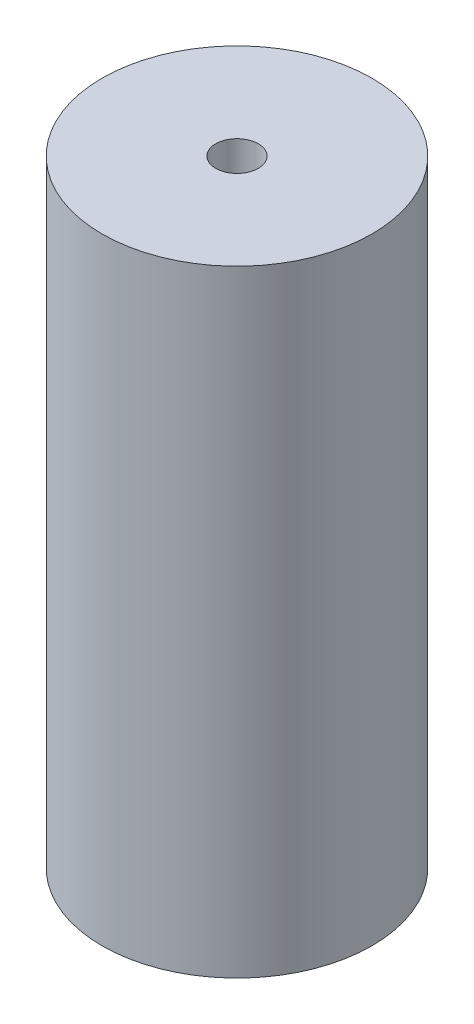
from build123d import *

# Parameters (mm, degrees)
SKETCH3_W = 8
SKETCH3_H = 43.4


with BuildPart() as part:
    # Sketch3 → Revolve1 (revolve)
    with BuildSketch(Plane(origin=(0, 0, 0), x_dir=(0, 0, -1), z_dir=(1, 0, 0)), mode=Mode.PRIVATE) as revolve1_sk:
        with Locations((-5.5, 0)):
            Rectangle(SKETCH3_W, SKETCH3_H)
    revolve(revolve1_sk.sketch.rotate(Axis((0, -50, 0), (0, 1, 0)), 180), axis=Axis((0, -50, 0), (0, 1, 0)))


solid = part.part
